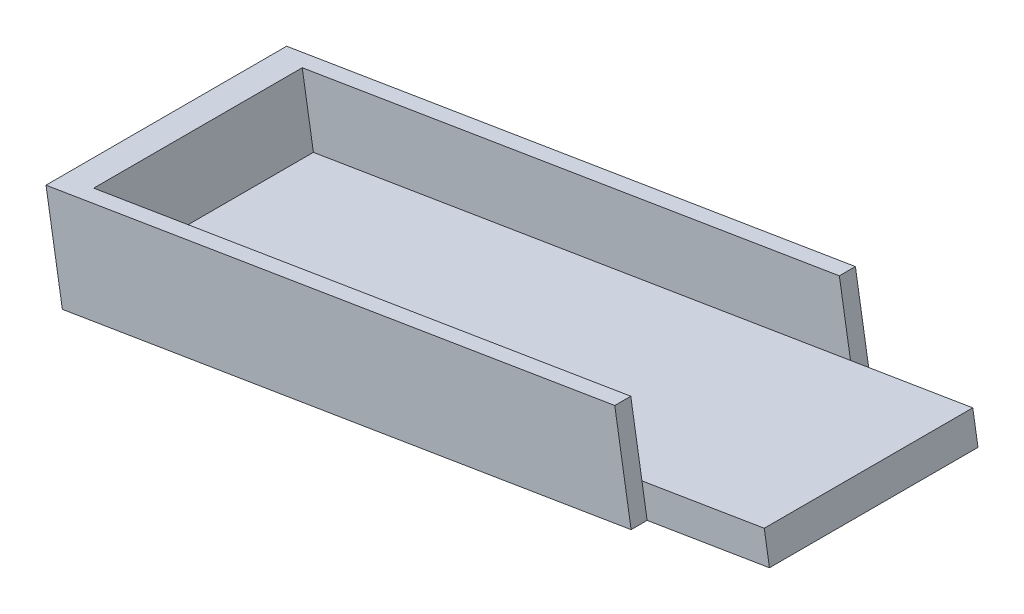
ISO-10303-21;
HEADER;
FILE_DESCRIPTION(('STEP AP214'),'2;1');
FILE_NAME('part.step','',(''),(''),'','','');
FILE_SCHEMA(('AUTOMOTIVE_DESIGN { 1 0 10303 214 1 1 1 1 }'));
ENDSEC;
DATA;
#1=APPLICATION_CONTEXT('core data for automotive mechanical design processes');
#2=APPLICATION_PROTOCOL_DEFINITION('international standard','automotive_design',2000,#1);
#3=PRODUCT_CONTEXT('',#1,'mechanical');
#4=PRODUCT('Part','Part','',(#3));
#5=PRODUCT_RELATED_PRODUCT_CATEGORY('part','',(#4));
#6=PRODUCT_DEFINITION_FORMATION('','',#4);
#7=PRODUCT_DEFINITION_CONTEXT('part definition',#1,'design');
#8=PRODUCT_DEFINITION('design','',#6,#7);
#9=PRODUCT_DEFINITION_SHAPE('','',#8);
#10=(LENGTH_UNIT() NAMED_UNIT(*) SI_UNIT(.MILLI.,.METRE.));
#11=(NAMED_UNIT(*) PLANE_ANGLE_UNIT() SI_UNIT($,.RADIAN.));
#12=(NAMED_UNIT(*) SI_UNIT($,.STERADIAN.) SOLID_ANGLE_UNIT());
#13=UNCERTAINTY_MEASURE_WITH_UNIT(LENGTH_MEASURE(1.E-05),#10,'distance_accuracy_value','');
#14=(GEOMETRIC_REPRESENTATION_CONTEXT(3) GLOBAL_UNCERTAINTY_ASSIGNED_CONTEXT((#13)) GLOBAL_UNIT_ASSIGNED_CONTEXT((#10,
#11,#12)) REPRESENTATION_CONTEXT('',''));
#15=CARTESIAN_POINT('',(0.,0.,0.));
#16=DIRECTION('',(0.,0.,1.));
#17=DIRECTION('',(1.,0.,0.));
#18=AXIS2_PLACEMENT_3D('',#15,#16,#17);
#19=CARTESIAN_POINT('',(-210.607357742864,-41.2815286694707,32.5));
#20=DIRECTION('',(0.,0.,-1.));
#21=DIRECTION('',(-1.,0.,0.));
#22=AXIS2_PLACEMENT_3D('',#19,#20,#21);
#23=PLANE('',#22);
#24=DIRECTION('',(-0.162309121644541,0.986739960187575,0.));
#25=VECTOR('',#24,1.);
#26=CARTESIAN_POINT('',(-43.212237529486,-13.7466602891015,32.5));
#27=LINE('',#26,#25);
#28=CARTESIAN_POINT('',(-38.1172424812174,-44.7211068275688,32.5));
#29=VERTEX_POINT('',#28);
#30=CARTESIAN_POINT('',(-39.7403336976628,-34.8537072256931,32.5));
#31=VERTEX_POINT('',#30);
#32=EDGE_CURVE('E50',#29,#31,#27,.T.);
#33=ORIENTED_EDGE('',*,*,#32,.F.);
#34=DIRECTION('',(-0.986739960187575,-0.16230912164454,0.));
#35=VECTOR('',#34,1.);
#36=CARTESIAN_POINT('',(0.,-38.4511913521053,32.5));
#37=LINE('',#36,#35);
#38=CARTESIAN_POINT('',(0.,-38.4511913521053,32.5));
#39=VERTEX_POINT('',#38);
#40=EDGE_CURVE('E161',#39,#29,#37,.T.);
#41=ORIENTED_EDGE('',*,*,#40,.F.);
#42=DIRECTION('',(0.16230912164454,-0.986739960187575,0.));
#43=VECTOR('',#42,1.);
#44=CARTESIAN_POINT('',(-1.6230912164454,-28.5837917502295,32.5));
#45=LINE('',#44,#43);
#46=CARTESIAN_POINT('',(-1.6230912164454,-28.5837917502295,32.5));
#47=VERTEX_POINT('',#46);
#48=EDGE_CURVE('E191',#47,#39,#45,.T.);
#49=ORIENTED_EDGE('',*,*,#48,.F.);
#50=DIRECTION('',(-0.986739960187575,-0.16230912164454,0.));
#51=VECTOR('',#50,1.);
#52=CARTESIAN_POINT('',(-1.6230912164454,-28.5837917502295,32.5));
#53=LINE('',#52,#51);
#54=EDGE_CURVE('E195',#47,#31,#53,.T.);
#55=ORIENTED_EDGE('',*,*,#54,.T.);
#56=EDGE_LOOP('',(#33,#41,#49,#55));
#57=FACE_BOUND('',#56,.T.);
#58=ADVANCED_FACE('F32',(#57),#23,.F.);
#59=CARTESIAN_POINT('',(-205.512362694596,-72.2559752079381,32.5));
#60=DIRECTION('',(-0.986739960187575,-0.16230912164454,0.));
#61=DIRECTION('',(0.16230912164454,-0.986739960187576,0.));
#62=AXIS2_PLACEMENT_3D('',#59,#60,#61);
#63=PLANE('',#62);
#64=DIRECTION('',(-0.16230912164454,0.986739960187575,0.));
#65=VECTOR('',#64,1.);
#66=CARTESIAN_POINT('',(-205.512362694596,-72.2559752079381,-32.5));
#67=LINE('',#66,#65);
#68=CARTESIAN_POINT('',(-207.135453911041,-62.3885756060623,-32.5));
#69=VERTEX_POINT('',#68);
#70=CARTESIAN_POINT('',(-210.607357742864,-41.2815286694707,-32.5));
#71=VERTEX_POINT('',#70);
#72=EDGE_CURVE('E205',#69,#71,#67,.T.);
#73=ORIENTED_EDGE('',*,*,#72,.T.);
#74=DIRECTION('',(0.,0.,-1.));
#75=VECTOR('',#74,1.);
#76=CARTESIAN_POINT('',(-210.607357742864,-41.2815286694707,32.5));
#77=LINE('',#76,#75);
#78=CARTESIAN_POINT('',(-210.607357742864,-41.2815286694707,32.5));
#79=VERTEX_POINT('',#78);
#80=EDGE_CURVE('E42',#79,#71,#77,.T.);
#81=ORIENTED_EDGE('',*,*,#80,.F.);
#82=DIRECTION('',(-0.16230912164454,0.986739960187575,0.));
#83=VECTOR('',#82,1.);
#84=CARTESIAN_POINT('',(-205.512362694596,-72.2559752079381,32.5));
#85=LINE('',#84,#83);
#86=CARTESIAN_POINT('',(-207.135453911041,-62.3885756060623,32.5));
#87=VERTEX_POINT('',#86);
#88=EDGE_CURVE('E36',#87,#79,#85,.T.);
#89=ORIENTED_EDGE('',*,*,#88,.F.);
#90=DIRECTION('',(0.,0.,-1.));
#91=VECTOR('',#90,1.);
#92=CARTESIAN_POINT('',(-207.135453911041,-62.3885756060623,32.5));
#93=LINE('',#92,#91);
#94=EDGE_CURVE('E197',#87,#69,#93,.T.);
#95=ORIENTED_EDGE('',*,*,#94,.T.);
#96=EDGE_LOOP('',(#73,#81,#89,#95));
#97=FACE_BOUND('',#96,.T.);
#98=ADVANCED_FACE('F34',(#97),#63,.F.);
#99=CARTESIAN_POINT('',(-220.47475734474,-42.9046198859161,32.5));
#100=DIRECTION('',(-0.16230912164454,0.986739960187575,0.));
#101=DIRECTION('',(-0.986739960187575,-0.16230912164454,0.));
#102=AXIS2_PLACEMENT_3D('',#99,#100,#101);
#103=PLANE('',#102);
#104=ORIENTED_EDGE('',*,*,#80,.T.);
#105=DIRECTION('',(0.986739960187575,0.16230912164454,0.));
#106=VECTOR('',#105,1.);
#107=CARTESIAN_POINT('',(-220.47475734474,-42.9046198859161,-32.5));
#108=LINE('',#107,#106);
#109=CARTESIAN_POINT('',(-43.212237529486,-13.7466602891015,-32.5));
#110=VERTEX_POINT('',#109);
#111=EDGE_CURVE('E164',#71,#110,#108,.T.);
#112=ORIENTED_EDGE('',*,*,#111,.T.);
#113=DIRECTION('',(0.,0.,1.));
#114=VECTOR('',#113,1.);
#115=CARTESIAN_POINT('',(-43.212237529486,-13.7466602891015,-37.5));
#116=LINE('',#115,#114);
#117=CARTESIAN_POINT('',(-43.212237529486,-13.7466602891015,-37.5));
#118=VERTEX_POINT('',#117);
#119=EDGE_CURVE('E187',#118,#110,#116,.T.);
#120=ORIENTED_EDGE('',*,*,#119,.F.);
#121=DIRECTION('',(0.986739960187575,0.16230912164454,0.));
#122=VECTOR('',#121,1.);
#123=CARTESIAN_POINT('',(-220.47475734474,-42.9046198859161,-37.5));
#124=LINE('',#123,#122);
#125=CARTESIAN_POINT('',(-220.47475734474,-42.9046198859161,-37.5));
#126=VERTEX_POINT('',#125);
#127=EDGE_CURVE('E174',#126,#118,#124,.T.);
#128=ORIENTED_EDGE('',*,*,#127,.F.);
#129=DIRECTION('',(0.,0.,-1.));
#130=VECTOR('',#129,1.);
#131=CARTESIAN_POINT('',(-220.47475734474,-42.9046198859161,32.5));
#132=LINE('',#131,#130);
#133=CARTESIAN_POINT('',(-220.47475734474,-42.9046198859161,37.5));
#134=VERTEX_POINT('',#133);
#135=EDGE_CURVE('E128',#134,#126,#132,.T.);
#136=ORIENTED_EDGE('',*,*,#135,.F.);
#137=DIRECTION('',(-0.986739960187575,-0.16230912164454,0.));
#138=VECTOR('',#137,1.);
#139=CARTESIAN_POINT('',(-220.47475734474,-42.9046198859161,37.5));
#140=LINE('',#139,#138);
#141=CARTESIAN_POINT('',(-43.212237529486,-13.7466602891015,37.5));
#142=VERTEX_POINT('',#141);
#143=EDGE_CURVE('E144',#142,#134,#140,.T.);
#144=ORIENTED_EDGE('',*,*,#143,.F.);
#145=DIRECTION('',(0.,0.,-1.));
#146=VECTOR('',#145,1.);
#147=CARTESIAN_POINT('',(-43.212237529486,-13.7466602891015,37.5));
#148=LINE('',#147,#146);
#149=CARTESIAN_POINT('',(-43.212237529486,-13.7466602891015,32.5));
#150=VERTEX_POINT('',#149);
#151=EDGE_CURVE('E152',#142,#150,#148,.T.);
#152=ORIENTED_EDGE('',*,*,#151,.T.);
#153=DIRECTION('',(-0.986739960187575,-0.16230912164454,0.));
#154=VECTOR('',#153,1.);
#155=CARTESIAN_POINT('',(-220.47475734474,-42.9046198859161,32.5));
#156=LINE('',#155,#154);
#157=EDGE_CURVE('E145',#150,#79,#156,.T.);
#158=ORIENTED_EDGE('',*,*,#157,.T.);
#159=EDGE_LOOP('',(#104,#112,#120,#128,#136,#144,#152,#158));
#160=FACE_BOUND('',#159,.T.);
#161=ADVANCED_FACE('F228',(#160),#103,.T.);
#162=CARTESIAN_POINT('',(-215.379762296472,-73.8790664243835,32.5));
#163=DIRECTION('',(-0.986739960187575,-0.16230912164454,0.));
#164=DIRECTION('',(0.16230912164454,-0.986739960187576,0.));
#165=AXIS2_PLACEMENT_3D('',#162,#163,#164);
#166=PLANE('',#165);
#167=ORIENTED_EDGE('',*,*,#135,.T.);
#168=DIRECTION('',(-0.16230912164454,0.986739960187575,0.));
#169=VECTOR('',#168,1.);
#170=CARTESIAN_POINT('',(-220.47475734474,-42.9046198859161,-37.5));
#171=LINE('',#170,#169);
#172=CARTESIAN_POINT('',(-215.379762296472,-73.8790664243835,-37.5));
#173=VERTEX_POINT('',#172);
#174=EDGE_CURVE('E124',#173,#126,#171,.T.);
#175=ORIENTED_EDGE('',*,*,#174,.F.);
#176=DIRECTION('',(0.,0.,-1.));
#177=VECTOR('',#176,1.);
#178=CARTESIAN_POINT('',(-215.379762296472,-73.8790664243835,32.5));
#179=LINE('',#178,#177);
#180=CARTESIAN_POINT('',(-215.379762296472,-73.8790664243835,37.5));
#181=VERTEX_POINT('',#180);
#182=EDGE_CURVE('E118',#181,#173,#179,.T.);
#183=ORIENTED_EDGE('',*,*,#182,.F.);
#184=DIRECTION('',(0.16230912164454,-0.986739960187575,0.));
#185=VECTOR('',#184,1.);
#186=CARTESIAN_POINT('',(-215.379762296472,-73.8790664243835,37.5));
#187=LINE('',#186,#185);
#188=EDGE_CURVE('E122',#134,#181,#187,.T.);
#189=ORIENTED_EDGE('',*,*,#188,.F.);
#190=EDGE_LOOP('',(#167,#175,#183,#189));
#191=FACE_BOUND('',#190,.T.);
#192=ADVANCED_FACE('F120',(#191),#166,.T.);
#193=CARTESIAN_POINT('',(0.,-38.4511913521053,32.5));
#194=DIRECTION('',(0.16230912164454,-0.986739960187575,0.));
#195=DIRECTION('',(0.986739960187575,0.16230912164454,0.));
#196=AXIS2_PLACEMENT_3D('',#193,#194,#195);
#197=PLANE('',#196);
#198=DIRECTION('',(-0.986739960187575,-0.16230912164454,0.));
#199=VECTOR('',#198,1.);
#200=CARTESIAN_POINT('',(0.,-38.4511913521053,-32.5));
#201=LINE('',#200,#199);
#202=CARTESIAN_POINT('',(0.,-38.4511913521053,-32.5));
#203=VERTEX_POINT('',#202);
#204=CARTESIAN_POINT('',(-38.1172424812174,-44.7211068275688,-32.5));
#205=VERTEX_POINT('',#204);
#206=EDGE_CURVE('E203',#203,#205,#201,.T.);
#207=ORIENTED_EDGE('',*,*,#206,.F.);
#208=DIRECTION('',(0.,0.,-1.));
#209=VECTOR('',#208,1.);
#210=CARTESIAN_POINT('',(0.,-38.4511913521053,32.5));
#211=LINE('',#210,#209);
#212=EDGE_CURVE('E129',#39,#203,#211,.T.);
#213=ORIENTED_EDGE('',*,*,#212,.F.);
#214=ORIENTED_EDGE('',*,*,#40,.T.);
#215=DIRECTION('',(0.,0.,-1.));
#216=VECTOR('',#215,1.);
#217=CARTESIAN_POINT('',(-38.1172424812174,-44.7211068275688,37.5));
#218=LINE('',#217,#216);
#219=CARTESIAN_POINT('',(-38.1172424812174,-44.7211068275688,37.5));
#220=VERTEX_POINT('',#219);
#221=EDGE_CURVE('E136',#220,#29,#218,.T.);
#222=ORIENTED_EDGE('',*,*,#221,.F.);
#223=DIRECTION('',(0.986739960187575,0.16230912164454,0.));
#224=VECTOR('',#223,1.);
#225=CARTESIAN_POINT('',(-38.1172424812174,-44.7211068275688,37.5));
#226=LINE('',#225,#224);
#227=EDGE_CURVE('E132',#181,#220,#226,.T.);
#228=ORIENTED_EDGE('',*,*,#227,.F.);
#229=ORIENTED_EDGE('',*,*,#182,.T.);
#230=DIRECTION('',(-0.986739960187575,-0.16230912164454,0.));
#231=VECTOR('',#230,1.);
#232=CARTESIAN_POINT('',(-215.379762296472,-73.8790664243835,-37.5));
#233=LINE('',#232,#231);
#234=CARTESIAN_POINT('',(-38.1172424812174,-44.7211068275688,-37.5));
#235=VERTEX_POINT('',#234);
#236=EDGE_CURVE('E179',#235,#173,#233,.T.);
#237=ORIENTED_EDGE('',*,*,#236,.F.);
#238=DIRECTION('',(0.,0.,1.));
#239=VECTOR('',#238,1.);
#240=CARTESIAN_POINT('',(-38.1172424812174,-44.7211068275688,-37.5));
#241=LINE('',#240,#239);
#242=EDGE_CURVE('E182',#235,#205,#241,.T.);
#243=ORIENTED_EDGE('',*,*,#242,.T.);
#244=EDGE_LOOP('',(#207,#213,#214,#222,#228,#229,#237,#243));
#245=FACE_BOUND('',#244,.T.);
#246=ADVANCED_FACE('F134',(#245),#197,.T.);
#247=CARTESIAN_POINT('',(-1.6230912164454,-28.5837917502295,32.5));
#248=DIRECTION('',(0.986739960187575,0.16230912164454,0.));
#249=DIRECTION('',(-0.16230912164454,0.986739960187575,0.));
#250=AXIS2_PLACEMENT_3D('',#247,#248,#249);
#251=PLANE('',#250);
#252=DIRECTION('',(0.16230912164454,-0.986739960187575,0.));
#253=VECTOR('',#252,1.);
#254=CARTESIAN_POINT('',(-1.6230912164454,-28.5837917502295,-32.5));
#255=LINE('',#254,#253);
#256=CARTESIAN_POINT('',(-1.6230912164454,-28.5837917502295,-32.5));
#257=VERTEX_POINT('',#256);
#258=EDGE_CURVE('E200',#257,#203,#255,.T.);
#259=ORIENTED_EDGE('',*,*,#258,.F.);
#260=DIRECTION('',(0.,0.,-1.));
#261=VECTOR('',#260,1.);
#262=CARTESIAN_POINT('',(-1.6230912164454,-28.5837917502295,32.5));
#263=LINE('',#262,#261);
#264=EDGE_CURVE('E238',#47,#257,#263,.T.);
#265=ORIENTED_EDGE('',*,*,#264,.F.);
#266=ORIENTED_EDGE('',*,*,#48,.T.);
#267=ORIENTED_EDGE('',*,*,#212,.T.);
#268=EDGE_LOOP('',(#259,#265,#266,#267));
#269=FACE_BOUND('',#268,.T.);
#270=ADVANCED_FACE('F242',(#269),#251,.T.);
#271=CARTESIAN_POINT('',(-1.6230912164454,-28.5837917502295,32.5));
#272=DIRECTION('',(0.16230912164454,-0.986739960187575,0.));
#273=DIRECTION('',(0.986739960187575,0.16230912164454,0.));
#274=AXIS2_PLACEMENT_3D('',#271,#272,#273);
#275=PLANE('',#274);
#276=DIRECTION('',(-0.986739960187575,-0.16230912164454,0.));
#277=VECTOR('',#276,1.);
#278=CARTESIAN_POINT('',(-1.6230912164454,-28.5837917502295,-32.5));
#279=LINE('',#278,#277);
#280=CARTESIAN_POINT('',(-39.7403336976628,-34.8537072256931,-32.5));
#281=VERTEX_POINT('',#280);
#282=EDGE_CURVE('E234',#257,#281,#279,.T.);
#283=ORIENTED_EDGE('',*,*,#282,.T.);
#284=EDGE_CURVE('E232',#281,#69,#279,.T.);
#285=ORIENTED_EDGE('',*,*,#284,.T.);
#286=ORIENTED_EDGE('',*,*,#94,.F.);
#287=EDGE_CURVE('E194',#31,#87,#53,.T.);
#288=ORIENTED_EDGE('',*,*,#287,.F.);
#289=ORIENTED_EDGE('',*,*,#54,.F.);
#290=ORIENTED_EDGE('',*,*,#264,.T.);
#291=EDGE_LOOP('',(#283,#285,#286,#288,#289,#290));
#292=FACE_BOUND('',#291,.T.);
#293=ADVANCED_FACE('F245',(#292),#275,.F.);
#294=CARTESIAN_POINT('',(-210.607357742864,-41.2815286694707,-32.5));
#295=DIRECTION('',(0.,0.,-1.));
#296=DIRECTION('',(-1.,0.,0.));
#297=AXIS2_PLACEMENT_3D('',#294,#295,#296);
#298=PLANE('',#297);
#299=DIRECTION('',(0.162309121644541,-0.986739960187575,0.));
#300=VECTOR('',#299,1.);
#301=CARTESIAN_POINT('',(-43.212237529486,-13.7466602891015,-32.5));
#302=LINE('',#301,#300);
#303=EDGE_CURVE('E11',#281,#205,#302,.T.);
#304=ORIENTED_EDGE('',*,*,#303,.F.);
#305=ORIENTED_EDGE('',*,*,#282,.F.);
#306=ORIENTED_EDGE('',*,*,#258,.T.);
#307=ORIENTED_EDGE('',*,*,#206,.T.);
#308=EDGE_LOOP('',(#304,#305,#306,#307));
#309=FACE_BOUND('',#308,.T.);
#310=ADVANCED_FACE('F244',(#309),#298,.T.);
#311=CARTESIAN_POINT('',(-43.212237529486,-13.7466602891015,-37.5));
#312=DIRECTION('',(-0.986739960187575,-0.162309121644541,0.));
#313=DIRECTION('',(0.162309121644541,-0.986739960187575,0.));
#314=AXIS2_PLACEMENT_3D('',#311,#312,#313);
#315=PLANE('',#314);
#316=EDGE_CURVE('E167',#110,#281,#302,.T.);
#317=ORIENTED_EDGE('',*,*,#316,.T.);
#318=ORIENTED_EDGE('',*,*,#303,.T.);
#319=ORIENTED_EDGE('',*,*,#242,.F.);
#320=DIRECTION('',(0.162309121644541,-0.986739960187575,0.));
#321=VECTOR('',#320,1.);
#322=CARTESIAN_POINT('',(-43.212237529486,-13.7466602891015,-37.5));
#323=LINE('',#322,#321);
#324=EDGE_CURVE('E177',#118,#235,#323,.T.);
#325=ORIENTED_EDGE('',*,*,#324,.F.);
#326=ORIENTED_EDGE('',*,*,#119,.T.);
#327=EDGE_LOOP('',(#317,#318,#319,#325,#326));
#328=FACE_BOUND('',#327,.T.);
#329=ADVANCED_FACE('F224',(#328),#315,.F.);
#330=CARTESIAN_POINT('',(-43.212237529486,-13.7466602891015,-37.5));
#331=DIRECTION('',(0.,0.,-1.));
#332=DIRECTION('',(-1.,0.,0.));
#333=AXIS2_PLACEMENT_3D('',#330,#331,#332);
#334=PLANE('',#333);
#335=ORIENTED_EDGE('',*,*,#127,.T.);
#336=ORIENTED_EDGE('',*,*,#324,.T.);
#337=ORIENTED_EDGE('',*,*,#236,.T.);
#338=ORIENTED_EDGE('',*,*,#174,.T.);
#339=EDGE_LOOP('',(#335,#336,#337,#338));
#340=FACE_BOUND('',#339,.T.);
#341=ADVANCED_FACE('F301',(#340),#334,.T.);
#342=CARTESIAN_POINT('',(-43.212237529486,-13.7466602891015,-32.5));
#343=DIRECTION('',(0.,0.,-1.));
#344=DIRECTION('',(-1.,0.,0.));
#345=AXIS2_PLACEMENT_3D('',#342,#343,#344);
#346=PLANE('',#345);
#347=ORIENTED_EDGE('',*,*,#72,.F.);
#348=ORIENTED_EDGE('',*,*,#284,.F.);
#349=ORIENTED_EDGE('',*,*,#316,.F.);
#350=ORIENTED_EDGE('',*,*,#111,.F.);
#351=EDGE_LOOP('',(#347,#348,#349,#350));
#352=FACE_BOUND('',#351,.T.);
#353=ADVANCED_FACE('F231',(#352),#346,.F.);
#354=CARTESIAN_POINT('',(-43.212237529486,-13.7466602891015,37.5));
#355=DIRECTION('',(-0.986739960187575,-0.162309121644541,0.));
#356=DIRECTION('',(0.162309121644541,-0.986739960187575,0.));
#357=AXIS2_PLACEMENT_3D('',#354,#355,#356);
#358=PLANE('',#357);
#359=ORIENTED_EDGE('',*,*,#32,.T.);
#360=EDGE_CURVE('E153',#31,#150,#27,.T.);
#361=ORIENTED_EDGE('',*,*,#360,.T.);
#362=ORIENTED_EDGE('',*,*,#151,.F.);
#363=DIRECTION('',(-0.162309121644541,0.986739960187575,0.));
#364=VECTOR('',#363,1.);
#365=CARTESIAN_POINT('',(-43.212237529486,-13.7466602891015,37.5));
#366=LINE('',#365,#364);
#367=EDGE_CURVE('E139',#220,#142,#366,.T.);
#368=ORIENTED_EDGE('',*,*,#367,.F.);
#369=ORIENTED_EDGE('',*,*,#221,.T.);
#370=EDGE_LOOP('',(#359,#361,#362,#368,#369));
#371=FACE_BOUND('',#370,.T.);
#372=ADVANCED_FACE('F314',(#371),#358,.F.);
#373=CARTESIAN_POINT('',(-220.47475734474,-42.9046198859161,37.5));
#374=DIRECTION('',(0.,0.,-1.));
#375=DIRECTION('',(-1.,0.,0.));
#376=AXIS2_PLACEMENT_3D('',#373,#374,#375);
#377=PLANE('',#376);
#378=ORIENTED_EDGE('',*,*,#188,.T.);
#379=ORIENTED_EDGE('',*,*,#227,.T.);
#380=ORIENTED_EDGE('',*,*,#367,.T.);
#381=ORIENTED_EDGE('',*,*,#143,.T.);
#382=EDGE_LOOP('',(#378,#379,#380,#381));
#383=FACE_BOUND('',#382,.T.);
#384=ADVANCED_FACE('F142',(#383),#377,.F.);
#385=CARTESIAN_POINT('',(-220.47475734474,-42.9046198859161,32.5));
#386=DIRECTION('',(0.,0.,-1.));
#387=DIRECTION('',(-1.,0.,0.));
#388=AXIS2_PLACEMENT_3D('',#385,#386,#387);
#389=PLANE('',#388);
#390=ORIENTED_EDGE('',*,*,#287,.T.);
#391=ORIENTED_EDGE('',*,*,#88,.T.);
#392=ORIENTED_EDGE('',*,*,#157,.F.);
#393=ORIENTED_EDGE('',*,*,#360,.F.);
#394=EDGE_LOOP('',(#390,#391,#392,#393));
#395=FACE_BOUND('',#394,.T.);
#396=ADVANCED_FACE('F253',(#395),#389,.T.);
#397=CLOSED_SHELL('',(#58,#98,#161,#192,#246,#270,#293,#310,#329,#341,#353,#372,#384,#396));
#398=MANIFOLD_SOLID_BREP('B2',#397);
#399=ADVANCED_BREP_SHAPE_REPRESENTATION('',(#18,#398),#14);
#400=SHAPE_DEFINITION_REPRESENTATION(#9,#399);
ENDSEC;
END-ISO-10303-21;
